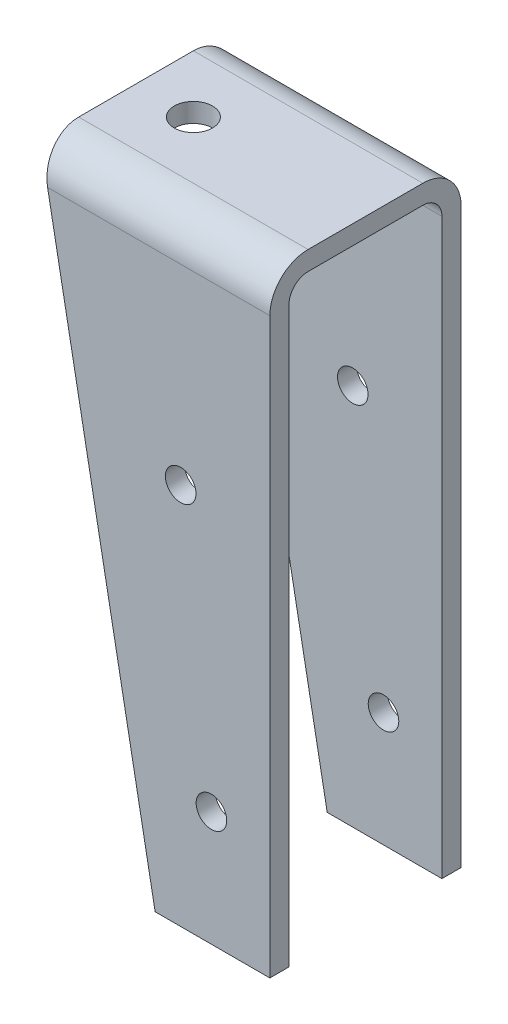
from build123d import *

# Parameters (mm, degrees)
EXTRUSION1_DEPTH                 = 50
ESQUISSE2_W                      = 40
ESQUISSE2_H                      = 155
ENL_V_MAT_EXTRU_1_DEPTH          = 179.044938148
CONG_2_R                         = 5
CONG_3_R                         = 10
ESQUISSE3_R                      = 4
ENL_V_MAT_EXTRU_2_DEPTH          = 179.044938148
TROU_TARAUD_M10X1_51_D           = 8.5
TROU_TARAUD_M10X1_51_CBORE_D     = 10
TROU_TARAUD_M10X1_51_CBORE_DEPTH = 20


with BuildPart() as part:
    # Esquisse1 → Extrusion1 (new body)
    with BuildSketch(Plane.XY):
        Polygon((0, 0), (0, 160), (-60, 160), (-30, 0), align=None)
    extrude(amount=EXTRUSION1_DEPTH)

    # Esquisse2 → Enl_v. mat.-Extru.1 (cut, through all)
    with BuildSketch(Plane(origin=(0, 0, 0), x_dir=(0, 0, -1), z_dir=(1, 0, 0))):
        with Locations((-25, 77.5)):
            Rectangle(ESQUISSE2_W, ESQUISSE2_H)
    extrude(amount=-ENL_V_MAT_EXTRU_1_DEPTH, mode=Mode.SUBTRACT)

    # Cong_2
    cong_2_edges = [part.edges().sort_by_distance(p)[0] for p in [
        (-29.53125, 155, 5),
        (-29.53125, 155, 45),
    ]]
    fillet(cong_2_edges, radius=CONG_2_R)

    # Cong_3
    cong_3_edges = [part.edges().sort_by_distance(p)[0] for p in [
        (-30, 160, 50),
        (-30, 160, 0),
    ]]
    fillet(cong_3_edges, radius=CONG_3_R)

    # Esquisse3 → Enl_v. mat.-Extru.2 (cut, through all)
    with BuildSketch(Plane.XY.offset(50)):
        with Locations((-23.314342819, 100)):
            Circle(ESQUISSE3_R)
        with Locations((-15.276474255, 30)):
            Circle(ESQUISSE3_R)
    extrude(amount=-ENL_V_MAT_EXTRU_2_DEPTH, mode=Mode.SUBTRACT)

    # Trou taraud_ M10x1.51 (through all)
    with Locations(Plane(origin=(0, 160, 0), x_dir=(-1, 0, 0), z_dir=(0, 1, 0))):
        with Locations((45, 25)):
            CounterBoreHole(TROU_TARAUD_M10X1_51_D / 2, TROU_TARAUD_M10X1_51_CBORE_D / 2, TROU_TARAUD_M10X1_51_CBORE_DEPTH)


solid = part.part
